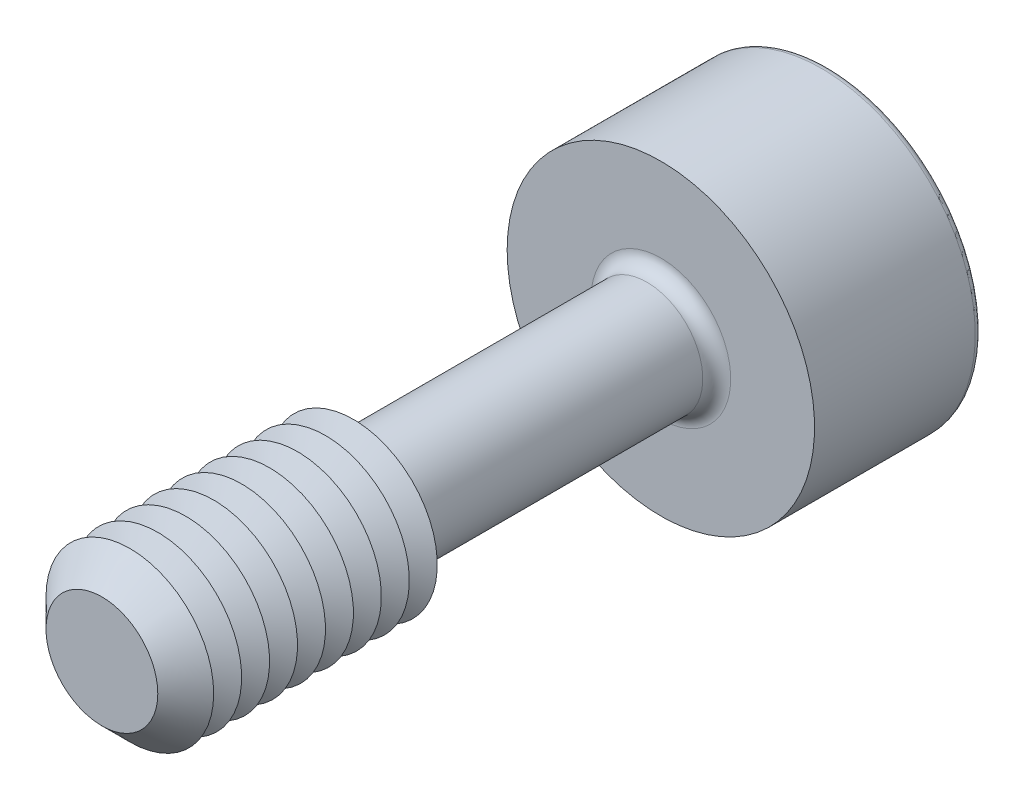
from build123d import *

# Parameters (mm, degrees)
SKETCH1_R       = 1
EXTRUDE1_DEPTH  = 5
CHAMFER1_SIZE   = 0.5
SKETCH3_R       = 2.75
EXTRUDE2_DEPTH  = 3
EXTRUDE3_DEPTH  = 2.5
FILLET1_R       = 0.25
FILLET2_R       = 0.125
LPATTERN1_COUNT = 8
LPATTERN1_PITCH = 0.5


with BuildPart() as part:
    # Sketch1 → Extrude1 (new, symmetric)
    with BuildSketch(Plane.XY):
        Circle(SKETCH1_R)
    extrude(amount=EXTRUDE1_DEPTH, both=True)

    # Sketch2 → Revolve1 (revolve)
    with BuildSketch(Plane(origin=(0, 0, 0), x_dir=(0, 0, -1), z_dir=(1, 0, 0))):
        Polygon((-5, 0), (-5, 1.5), (-0.5, 1.5), (-0.211324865, 1), (-0.211324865, 0), align=None)
    revolve(axis=Axis((0, 0, 0.211324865), (0, 0, 1)))

    # Chamfer1
    chamfer1_edges = [part.edges().sort_by_distance(p)[0] for p in [
        (0, -1.5, 5),
    ]]
    chamfer(chamfer1_edges, length=CHAMFER1_SIZE)

    # Sketch3 → Extrude2 (add)
    with BuildSketch(Plane(origin=(0, 0, -5), x_dir=(-1, 0, 0), z_dir=(0, 0, -1))):
        Circle(SKETCH3_R)
    extrude(amount=EXTRUDE2_DEPTH)

    # Sketch4 → Extrude3 (cut)
    with BuildSketch(Plane(origin=(-13.7, 0, -8), x_dir=(1, 0, 0), z_dir=(0, 0, 1))):
        Polygon((12.978312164, -1.25), (14.421687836, -1.25), (15.143375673, 0), (14.421687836, 1.25), (12.978312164, 1.25), (12.256624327, 0), align=None)
    extrude(amount=EXTRUDE3_DEPTH, mode=Mode.SUBTRACT)

    # Fillet1
    fillet1_edges = [part.edges().sort_by_distance(p)[0] for p in [
        (-1, 0, -5),
    ]]
    fillet(fillet1_edges, radius=FILLET1_R)

    # Fillet2
    fillet2_edges = [part.edges().sort_by_distance(p)[0] for p in [
        (2.75, 0, -8),
    ]]
    fillet(fillet2_edges, radius=FILLET2_R)

    # Sketch5 → Cut-Revolve1 (revolve, cut)
    with BuildSketch(Plane(origin=(0, 0, 0), x_dir=(0, 0, -1), z_dir=(1, 0, 0)), mode=Mode.PRIVATE) as cut_revolve1_sk:
        Polygon((5.5, 0), (5.5, -1.25), (4.778312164, 0), align=None)
    revolve(cut_revolve1_sk.sketch.rotate(Axis((0, 0, -4.778312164), (0, 0, -1)), 90), axis=Axis((0, 0, -4.778312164), (0, 0, -1)), mode=Mode.SUBTRACT)

    # Sketch7 → Cut-Revolve2 (revolve, cut)
    with BuildSketch(Plane(origin=(0, 0, 0), x_dir=(0, 0, -1), z_dir=(1, 0, 0)), mode=Mode.PRIVATE) as cut_revolve2_sk:
        Polygon((-0.5, 1.5), (-0.75, 1.066987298), (-1, 1.5), align=None)
    cut_revolve2 = revolve(cut_revolve2_sk.sketch.rotate(Axis((0, 0, -1.332048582), (0, 0, 1)), 90), axis=Axis((0, 0, -1.332048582), (0, 0, 1)), mode=Mode.SUBTRACT)

    # LPattern1: Cut-Revolve2 ×8
    with Locations(*[(0, 0, i * LPATTERN1_PITCH) for i in range(1, LPATTERN1_COUNT)]):
        add(cut_revolve2, mode=Mode.SUBTRACT)


solid = part.part
